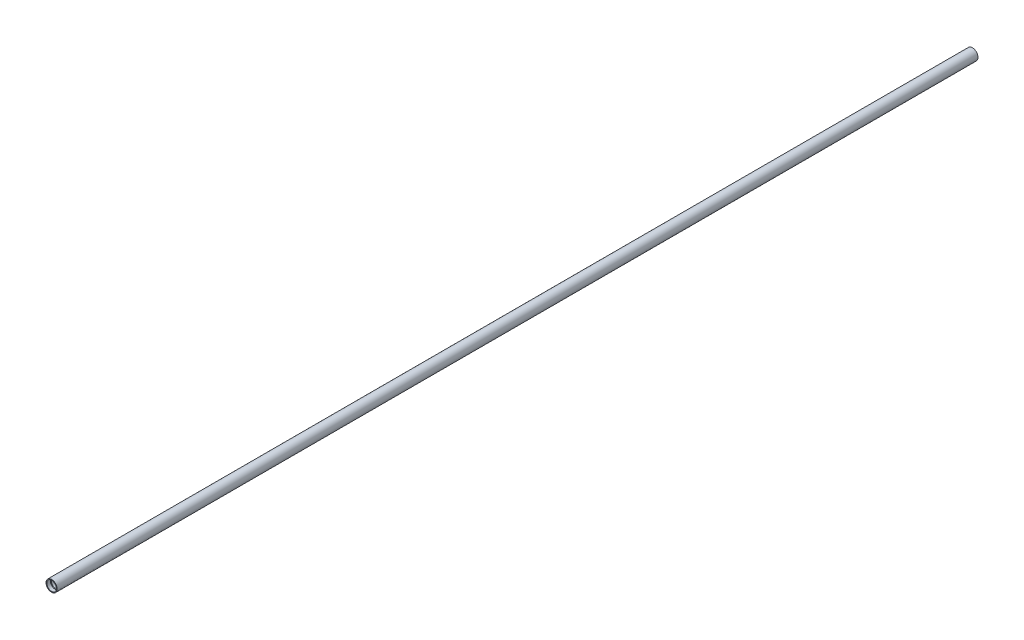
ISO-10303-21;
HEADER;
FILE_DESCRIPTION(('STEP AP214'),'2;1');
FILE_NAME('part.step','',(''),(''),'','','');
FILE_SCHEMA(('AUTOMOTIVE_DESIGN { 1 0 10303 214 1 1 1 1 }'));
ENDSEC;
DATA;
#1=APPLICATION_CONTEXT('core data for automotive mechanical design processes');
#2=APPLICATION_PROTOCOL_DEFINITION('international standard','automotive_design',2000,#1);
#3=PRODUCT_CONTEXT('',#1,'mechanical');
#4=PRODUCT('Part','Part','',(#3));
#5=PRODUCT_RELATED_PRODUCT_CATEGORY('part','',(#4));
#6=PRODUCT_DEFINITION_FORMATION('','',#4);
#7=PRODUCT_DEFINITION_CONTEXT('part definition',#1,'design');
#8=PRODUCT_DEFINITION('design','',#6,#7);
#9=PRODUCT_DEFINITION_SHAPE('','',#8);
#10=(LENGTH_UNIT() NAMED_UNIT(*) SI_UNIT(.MILLI.,.METRE.));
#11=(NAMED_UNIT(*) PLANE_ANGLE_UNIT() SI_UNIT($,.RADIAN.));
#12=(NAMED_UNIT(*) SI_UNIT($,.STERADIAN.) SOLID_ANGLE_UNIT());
#13=UNCERTAINTY_MEASURE_WITH_UNIT(LENGTH_MEASURE(1.E-05),#10,'distance_accuracy_value','');
#14=(GEOMETRIC_REPRESENTATION_CONTEXT(3) GLOBAL_UNCERTAINTY_ASSIGNED_CONTEXT((#13)) GLOBAL_UNIT_ASSIGNED_CONTEXT((#10,
#11,#12)) REPRESENTATION_CONTEXT('',''));
#15=CARTESIAN_POINT('',(0.,0.,0.));
#16=DIRECTION('',(0.,0.,1.));
#17=DIRECTION('',(1.,0.,0.));
#18=AXIS2_PLACEMENT_3D('',#15,#16,#17);
#19=CARTESIAN_POINT('',(0.,0.,196.088));
#20=DIRECTION('',(0.,0.,-1.));
#21=DIRECTION('',(-1.,0.,0.));
#22=AXIS2_PLACEMENT_3D('',#19,#20,#21);
#23=CYLINDRICAL_SURFACE('',#22,2.3749);
#24=CARTESIAN_POINT('',(0.,0.,196.088));
#25=DIRECTION('',(0.,0.,1.));
#26=DIRECTION('',(1.,0.,0.));
#27=AXIS2_PLACEMENT_3D('',#24,#25,#26);
#28=CIRCLE('',#27,2.3749);
#29=CARTESIAN_POINT('',(2.3749,0.,196.088));
#30=VERTEX_POINT('',#29);
#31=EDGE_CURVE('E11',#30,#30,#28,.T.);
#32=ORIENTED_EDGE('',*,*,#31,.F.);
#33=EDGE_LOOP('',(#32));
#34=FACE_BOUND('',#33,.T.);
#35=CARTESIAN_POINT('',(0.,0.,-196.088));
#36=DIRECTION('',(0.,0.,1.));
#37=DIRECTION('',(1.,0.,0.));
#38=AXIS2_PLACEMENT_3D('',#35,#36,#37);
#39=CIRCLE('',#38,2.3749);
#40=CARTESIAN_POINT('',(2.3749,0.,-196.088));
#41=VERTEX_POINT('',#40);
#42=EDGE_CURVE('E41',#41,#41,#39,.T.);
#43=ORIENTED_EDGE('',*,*,#42,.T.);
#44=EDGE_LOOP('',(#43));
#45=FACE_BOUND('',#44,.T.);
#46=ADVANCED_FACE('F33',(#34,#45),#23,.T.);
#47=CARTESIAN_POINT('',(0.,0.,196.088));
#48=DIRECTION('',(0.,0.,1.));
#49=DIRECTION('',(1.,0.,0.));
#50=AXIS2_PLACEMENT_3D('',#47,#48,#49);
#51=PLANE('',#50);
#52=CARTESIAN_POINT('',(0.,0.,196.088));
#53=DIRECTION('',(0.,0.,1.));
#54=DIRECTION('',(1.,0.,0.));
#55=AXIS2_PLACEMENT_3D('',#52,#53,#54);
#56=CIRCLE('',#55,2.0447);
#57=CARTESIAN_POINT('',(2.0447,0.,196.088));
#58=VERTEX_POINT('',#57);
#59=EDGE_CURVE('E73',#58,#58,#56,.T.);
#60=ORIENTED_EDGE('',*,*,#59,.F.);
#61=EDGE_LOOP('',(#60));
#62=FACE_BOUND('',#61,.T.);
#63=ORIENTED_EDGE('',*,*,#31,.T.);
#64=EDGE_LOOP('',(#63));
#65=FACE_BOUND('',#64,.T.);
#66=ADVANCED_FACE('F98',(#62,#65),#51,.T.);
#67=CARTESIAN_POINT('',(0.,0.,-196.088));
#68=DIRECTION('',(0.,0.,1.));
#69=DIRECTION('',(1.,0.,0.));
#70=AXIS2_PLACEMENT_3D('',#67,#68,#69);
#71=PLANE('',#70);
#72=CARTESIAN_POINT('',(0.,0.,-196.088));
#73=DIRECTION('',(0.,0.,-1.));
#74=DIRECTION('',(-1.,0.,0.));
#75=AXIS2_PLACEMENT_3D('',#72,#73,#74);
#76=CIRCLE('',#75,1.8669);
#77=CARTESIAN_POINT('',(-1.8669,0.,-196.088));
#78=VERTEX_POINT('',#77);
#79=EDGE_CURVE('E63',#78,#78,#76,.T.);
#80=ORIENTED_EDGE('',*,*,#79,.F.);
#81=EDGE_LOOP('',(#80));
#82=FACE_BOUND('',#81,.T.);
#83=ORIENTED_EDGE('',*,*,#42,.F.);
#84=EDGE_LOOP('',(#83));
#85=FACE_BOUND('',#84,.T.);
#86=ADVANCED_FACE('F103',(#82,#85),#71,.F.);
#87=CARTESIAN_POINT('',(0.,0.,196.088));
#88=DIRECTION('',(0.,0.,1.));
#89=DIRECTION('',(1.,0.,0.));
#90=AXIS2_PLACEMENT_3D('',#87,#88,#89);
#91=CYLINDRICAL_SURFACE('',#90,2.0447);
#92=CARTESIAN_POINT('',(0.,0.,194.564));
#93=DIRECTION('',(0.,0.,1.));
#94=DIRECTION('',(1.,0.,0.));
#95=AXIS2_PLACEMENT_3D('',#92,#93,#94);
#96=CIRCLE('',#95,2.0447);
#97=CARTESIAN_POINT('',(2.0447,0.,194.564));
#98=VERTEX_POINT('',#97);
#99=EDGE_CURVE('E70',#98,#98,#96,.T.);
#100=ORIENTED_EDGE('',*,*,#99,.F.);
#101=EDGE_LOOP('',(#100));
#102=FACE_BOUND('',#101,.T.);
#103=ORIENTED_EDGE('',*,*,#59,.T.);
#104=EDGE_LOOP('',(#103));
#105=FACE_BOUND('',#104,.T.);
#106=ADVANCED_FACE('F94',(#102,#105),#91,.F.);
#107=CARTESIAN_POINT('',(0.,0.,194.564));
#108=DIRECTION('',(0.,0.,1.));
#109=DIRECTION('',(1.,0.,0.));
#110=AXIS2_PLACEMENT_3D('',#107,#108,#109);
#111=CONICAL_SURFACE('',#110,2.0447,1.02974425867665);
#112=CARTESIAN_POINT('',(0.,0.,194.403750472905));
#113=DIRECTION('',(0.,0.,1.));
#114=DIRECTION('',(1.,0.,0.));
#115=AXIS2_PLACEMENT_3D('',#112,#113,#114);
#116=CIRCLE('',#115,1.77799999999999);
#117=CARTESIAN_POINT('',(1.77799999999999,0.,194.403750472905));
#118=VERTEX_POINT('',#117);
#119=EDGE_CURVE('E69',#118,#118,#116,.F.);
#120=ORIENTED_EDGE('',*,*,#119,.T.);
#121=EDGE_LOOP('',(#120));
#122=FACE_BOUND('',#121,.T.);
#123=ORIENTED_EDGE('',*,*,#99,.T.);
#124=EDGE_LOOP('',(#123));
#125=FACE_BOUND('',#124,.T.);
#126=ADVANCED_FACE('F80',(#122,#125),#111,.F.);
#127=CARTESIAN_POINT('',(0.,0.,196.088));
#128=DIRECTION('',(0.,0.,1.));
#129=DIRECTION('',(1.,0.,0.));
#130=AXIS2_PLACEMENT_3D('',#127,#128,#129);
#131=CYLINDRICAL_SURFACE('',#130,1.77799999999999);
#132=CARTESIAN_POINT('',(0.,0.,156.464));
#133=DIRECTION('',(0.,0.,1.));
#134=DIRECTION('',(1.,0.,0.));
#135=AXIS2_PLACEMENT_3D('',#132,#133,#134);
#136=CIRCLE('',#135,1.77799999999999);
#137=CARTESIAN_POINT('',(1.77799999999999,0.,156.464));
#138=VERTEX_POINT('',#137);
#139=EDGE_CURVE('E66',#138,#138,#136,.T.);
#140=ORIENTED_EDGE('',*,*,#139,.F.);
#141=EDGE_LOOP('',(#140));
#142=FACE_BOUND('',#141,.T.);
#143=ORIENTED_EDGE('',*,*,#119,.F.);
#144=EDGE_LOOP('',(#143));
#145=FACE_BOUND('',#144,.T.);
#146=ADVANCED_FACE('F83',(#142,#145),#131,.F.);
#147=CARTESIAN_POINT('',(0.,0.,156.464));
#148=DIRECTION('',(0.,0.,1.));
#149=DIRECTION('',(1.,0.,0.));
#150=AXIS2_PLACEMENT_3D('',#147,#148,#149);
#151=CONICAL_SURFACE('',#150,1.77799999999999,1.02974425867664);
#152=CARTESIAN_POINT('',(0.,0.,155.395669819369));
#153=VERTEX_POINT('',#152);
#154=VERTEX_LOOP('',#153);
#155=FACE_BOUND('',#154,.T.);
#156=ORIENTED_EDGE('',*,*,#139,.T.);
#157=EDGE_LOOP('',(#156));
#158=FACE_BOUND('',#157,.T.);
#159=ADVANCED_FACE('F85',(#155,#158),#151,.F.);
#160=CARTESIAN_POINT('',(0.,0.,-196.088));
#161=DIRECTION('',(0.,0.,-1.));
#162=DIRECTION('',(-1.,0.,0.));
#163=AXIS2_PLACEMENT_3D('',#160,#161,#162);
#164=CYLINDRICAL_SURFACE('',#163,1.86689999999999);
#165=CARTESIAN_POINT('',(0.,0.,-194.31));
#166=DIRECTION('',(0.,0.,-1.));
#167=DIRECTION('',(-1.,0.,0.));
#168=AXIS2_PLACEMENT_3D('',#165,#166,#167);
#169=CIRCLE('',#168,1.86689999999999);
#170=CARTESIAN_POINT('',(-1.86689999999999,0.,-194.31));
#171=VERTEX_POINT('',#170);
#172=EDGE_CURVE('E59',#171,#171,#169,.T.);
#173=ORIENTED_EDGE('',*,*,#172,.F.);
#174=EDGE_LOOP('',(#173));
#175=FACE_BOUND('',#174,.T.);
#176=ORIENTED_EDGE('',*,*,#79,.T.);
#177=EDGE_LOOP('',(#176));
#178=FACE_BOUND('',#177,.T.);
#179=ADVANCED_FACE('F92',(#175,#178),#164,.F.);
#180=CARTESIAN_POINT('',(0.,0.,-194.31));
#181=DIRECTION('',(0.,0.,-1.));
#182=DIRECTION('',(-1.,0.,0.));
#183=AXIS2_PLACEMENT_3D('',#180,#181,#182);
#184=CONICAL_SURFACE('',#183,1.86689999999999,1.02974425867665);
#185=CARTESIAN_POINT('',(0.,0.,-193.997131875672));
#186=DIRECTION('',(0.,0.,-1.));
#187=DIRECTION('',(-1.,0.,0.));
#188=AXIS2_PLACEMENT_3D('',#185,#186,#187);
#189=CIRCLE('',#188,1.3462);
#190=CARTESIAN_POINT('',(-1.3462,0.,-193.997131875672));
#191=VERTEX_POINT('',#190);
#192=EDGE_CURVE('E36',#191,#191,#189,.F.);
#193=ORIENTED_EDGE('',*,*,#192,.T.);
#194=EDGE_LOOP('',(#193));
#195=FACE_BOUND('',#194,.T.);
#196=ORIENTED_EDGE('',*,*,#172,.T.);
#197=EDGE_LOOP('',(#196));
#198=FACE_BOUND('',#197,.T.);
#199=ADVANCED_FACE('F120',(#195,#198),#184,.F.);
#200=CARTESIAN_POINT('',(0.,0.,-196.088));
#201=DIRECTION('',(0.,0.,-1.));
#202=DIRECTION('',(-1.,0.,0.));
#203=AXIS2_PLACEMENT_3D('',#200,#201,#202);
#204=CYLINDRICAL_SURFACE('',#203,1.3462);
#205=CARTESIAN_POINT('',(0.,0.,-173.736));
#206=DIRECTION('',(0.,0.,-1.));
#207=DIRECTION('',(-1.,0.,0.));
#208=AXIS2_PLACEMENT_3D('',#205,#206,#207);
#209=CIRCLE('',#208,1.34619999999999);
#210=CARTESIAN_POINT('',(-1.34619999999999,0.,-173.736));
#211=VERTEX_POINT('',#210);
#212=EDGE_CURVE('E55',#211,#211,#209,.T.);
#213=ORIENTED_EDGE('',*,*,#212,.F.);
#214=EDGE_LOOP('',(#213));
#215=FACE_BOUND('',#214,.T.);
#216=ORIENTED_EDGE('',*,*,#192,.F.);
#217=EDGE_LOOP('',(#216));
#218=FACE_BOUND('',#217,.T.);
#219=ADVANCED_FACE('F51',(#215,#218),#204,.F.);
#220=CARTESIAN_POINT('',(0.,0.,-173.736));
#221=DIRECTION('',(0.,0.,-1.));
#222=DIRECTION('',(-1.,0.,0.));
#223=AXIS2_PLACEMENT_3D('',#220,#221,#222);
#224=CONICAL_SURFACE('',#223,1.34619999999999,1.02974425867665);
#225=CARTESIAN_POINT('',(0.,0.,-172.927121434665));
#226=VERTEX_POINT('',#225);
#227=VERTEX_LOOP('',#226);
#228=FACE_BOUND('',#227,.T.);
#229=ORIENTED_EDGE('',*,*,#212,.T.);
#230=EDGE_LOOP('',(#229));
#231=FACE_BOUND('',#230,.T.);
#232=ADVANCED_FACE('F48',(#228,#231),#224,.F.);
#233=CLOSED_SHELL('',(#46,#66,#86,#106,#126,#146,#159,#179,#199,#219,#232));
#234=MANIFOLD_SOLID_BREP('B2',#233);
#235=ADVANCED_BREP_SHAPE_REPRESENTATION('',(#18,#234),#14);
#236=SHAPE_DEFINITION_REPRESENTATION(#9,#235);
ENDSEC;
END-ISO-10303-21;
